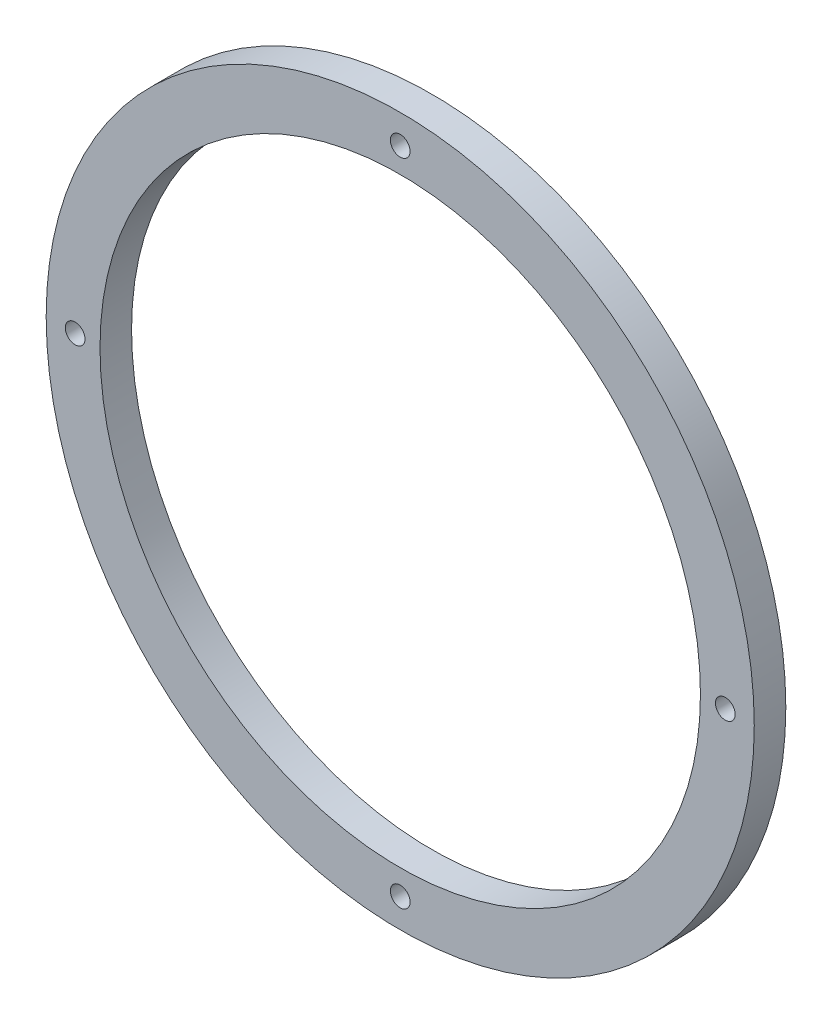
from build123d import *

# Parameters (mm, degrees)
SKETCH1_R           = 85.5
SKETCH1_R_2         = 72.5
SKETCH1_R_3         = 2.38125
BOSS_EXTRUDE1_DEPTH = 7.62


with BuildPart() as part:
    # Sketch1 → Boss-Extrude1 (new body)
    with BuildSketch(Plane.XY):
        with Locations(Location((0, 0, 0), (0, 0, 180))):
            Circle(SKETCH1_R)
        with Locations(Location((0, 0, 0), (0, 0, 180))):
            Circle(SKETCH1_R_2, mode=Mode.SUBTRACT)
        with Locations(Location((0, 78.5, 0), (0, 0, 180))):
            Circle(SKETCH1_R_3, mode=Mode.SUBTRACT)
        with Locations(Location((78.5, 0, 0), (0, 0, 180))):
            Circle(SKETCH1_R_3, mode=Mode.SUBTRACT)
        with Locations(Location((0, -78.5, 0), (0, 0, 180))):
            Circle(SKETCH1_R_3, mode=Mode.SUBTRACT)
        with Locations(Location((-78.5, 0, 0), (0, 0, 180))):
            Circle(SKETCH1_R_3, mode=Mode.SUBTRACT)
    extrude(amount=BOSS_EXTRUDE1_DEPTH)


solid = part.part
